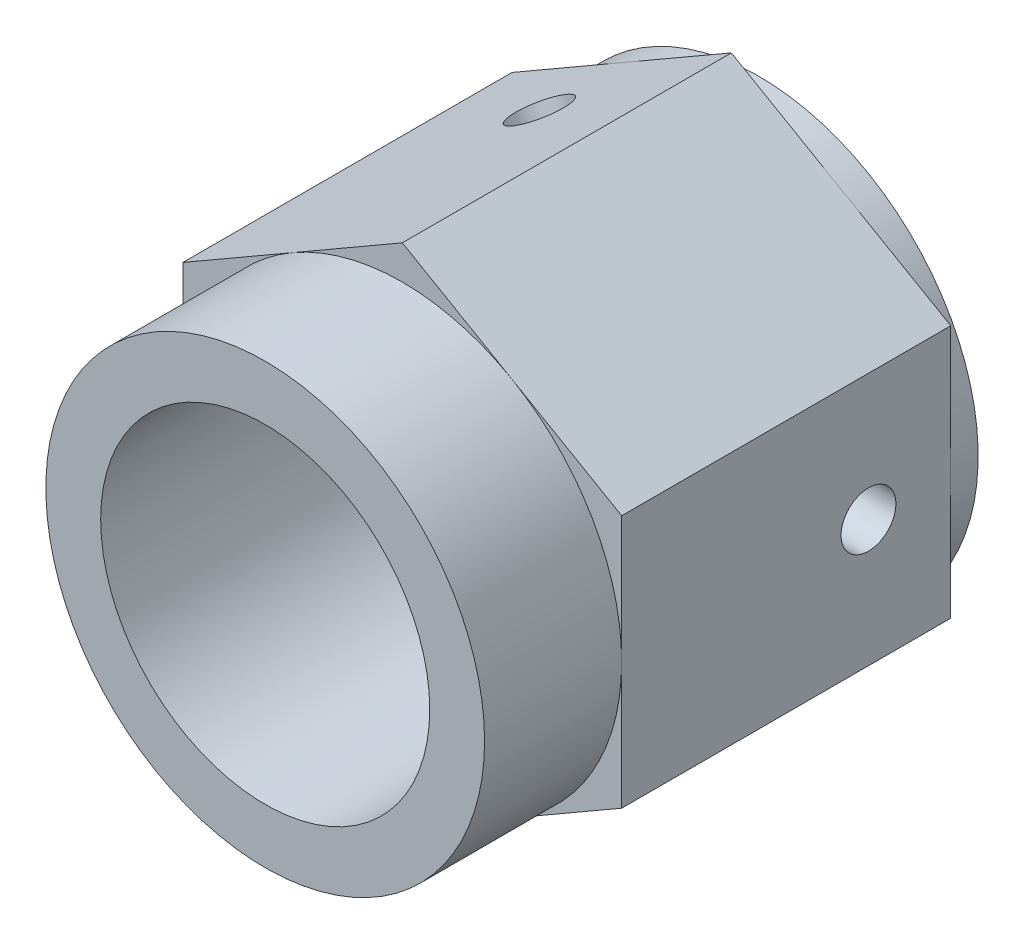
ISO-10303-21;
HEADER;
FILE_DESCRIPTION(('STEP AP214'),'2;1');
FILE_NAME('part.step','',(''),(''),'','','');
FILE_SCHEMA(('AUTOMOTIVE_DESIGN { 1 0 10303 214 1 1 1 1 }'));
ENDSEC;
DATA;
#1=APPLICATION_CONTEXT('core data for automotive mechanical design processes');
#2=APPLICATION_PROTOCOL_DEFINITION('international standard','automotive_design',2000,#1);
#3=PRODUCT_CONTEXT('',#1,'mechanical');
#4=PRODUCT('Part','Part','',(#3));
#5=PRODUCT_RELATED_PRODUCT_CATEGORY('part','',(#4));
#6=PRODUCT_DEFINITION_FORMATION('','',#4);
#7=PRODUCT_DEFINITION_CONTEXT('part definition',#1,'design');
#8=PRODUCT_DEFINITION('design','',#6,#7);
#9=PRODUCT_DEFINITION_SHAPE('','',#8);
#10=(LENGTH_UNIT() NAMED_UNIT(*) SI_UNIT(.MILLI.,.METRE.));
#11=(NAMED_UNIT(*) PLANE_ANGLE_UNIT() SI_UNIT($,.RADIAN.));
#12=(NAMED_UNIT(*) SI_UNIT($,.STERADIAN.) SOLID_ANGLE_UNIT());
#13=UNCERTAINTY_MEASURE_WITH_UNIT(LENGTH_MEASURE(1.E-05),#10,'distance_accuracy_value','');
#14=(GEOMETRIC_REPRESENTATION_CONTEXT(3) GLOBAL_UNCERTAINTY_ASSIGNED_CONTEXT((#13)) GLOBAL_UNIT_ASSIGNED_CONTEXT((#10,
#11,#12)) REPRESENTATION_CONTEXT('',''));
#15=CARTESIAN_POINT('',(0.,0.,0.));
#16=DIRECTION('',(0.,0.,1.));
#17=DIRECTION('',(1.,0.,0.));
#18=AXIS2_PLACEMENT_3D('',#15,#16,#17);
#19=CARTESIAN_POINT('',(0.,0.,0.));
#20=DIRECTION('',(0.,0.,1.));
#21=DIRECTION('',(1.,0.,0.));
#22=AXIS2_PLACEMENT_3D('',#19,#20,#21);
#23=PLANE('',#22);
#24=CARTESIAN_POINT('',(0.,0.,0.));
#25=DIRECTION('',(0.,0.,-1.));
#26=DIRECTION('',(-1.,0.,0.));
#27=AXIS2_PLACEMENT_3D('',#24,#25,#26);
#28=CIRCLE('',#27,40.);
#29=CARTESIAN_POINT('',(-40.,0.,0.));
#30=VERTEX_POINT('',#29);
#31=CARTESIAN_POINT('',(-20.,34.6410161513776,0.));
#32=VERTEX_POINT('',#31);
#33=EDGE_CURVE('E51',#30,#32,#28,.T.);
#34=ORIENTED_EDGE('',*,*,#33,.F.);
#35=DIRECTION('',(0.,-1.,0.));
#36=VECTOR('',#35,1.);
#37=CARTESIAN_POINT('',(-40.,23.094010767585,0.));
#38=LINE('',#37,#36);
#39=CARTESIAN_POINT('',(-40.,23.094010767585,0.));
#40=VERTEX_POINT('',#39);
#41=EDGE_CURVE('E134',#40,#30,#38,.T.);
#42=ORIENTED_EDGE('',*,*,#41,.F.);
#43=DIRECTION('',(-0.866025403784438,-0.5,0.));
#44=VECTOR('',#43,1.);
#45=CARTESIAN_POINT('',(0.,46.1880215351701,0.));
#46=LINE('',#45,#44);
#47=EDGE_CURVE('E151',#32,#40,#46,.T.);
#48=ORIENTED_EDGE('',*,*,#47,.F.);
#49=EDGE_LOOP('',(#34,#42,#48));
#50=FACE_BOUND('',#49,.T.);
#51=ADVANCED_FACE('F36',(#50),#23,.F.);
#52=CARTESIAN_POINT('',(20.,34.6410161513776,0.));
#53=VERTEX_POINT('',#52);
#54=EDGE_CURVE('E11',#32,#53,#28,.T.);
#55=ORIENTED_EDGE('',*,*,#54,.F.);
#56=CARTESIAN_POINT('',(0.,46.1880215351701,0.));
#57=VERTEX_POINT('',#56);
#58=EDGE_CURVE('E149',#57,#32,#46,.T.);
#59=ORIENTED_EDGE('',*,*,#58,.F.);
#60=DIRECTION('',(-0.866025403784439,0.5,0.));
#61=VECTOR('',#60,1.);
#62=CARTESIAN_POINT('',(40.,23.0940107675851,0.));
#63=LINE('',#62,#61);
#64=EDGE_CURVE('E171',#53,#57,#63,.T.);
#65=ORIENTED_EDGE('',*,*,#64,.F.);
#66=EDGE_LOOP('',(#55,#59,#65));
#67=FACE_BOUND('',#66,.T.);
#68=ADVANCED_FACE('F259',(#67),#23,.F.);
#69=CARTESIAN_POINT('',(40.,0.,0.));
#70=VERTEX_POINT('',#69);
#71=EDGE_CURVE('E49',#53,#70,#28,.T.);
#72=ORIENTED_EDGE('',*,*,#71,.F.);
#73=CARTESIAN_POINT('',(40.,23.0940107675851,0.));
#74=VERTEX_POINT('',#73);
#75=EDGE_CURVE('E199',#74,#53,#63,.T.);
#76=ORIENTED_EDGE('',*,*,#75,.F.);
#77=DIRECTION('',(0.,1.,0.));
#78=VECTOR('',#77,1.);
#79=CARTESIAN_POINT('',(40.,-23.094010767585,0.));
#80=LINE('',#79,#78);
#81=EDGE_CURVE('E208',#70,#74,#80,.T.);
#82=ORIENTED_EDGE('',*,*,#81,.F.);
#83=EDGE_LOOP('',(#72,#76,#82));
#84=FACE_BOUND('',#83,.T.);
#85=ADVANCED_FACE('F265',(#84),#23,.F.);
#86=CARTESIAN_POINT('',(20.,-34.6410161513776,0.));
#87=VERTEX_POINT('',#86);
#88=EDGE_CURVE('E161',#70,#87,#28,.T.);
#89=ORIENTED_EDGE('',*,*,#88,.F.);
#90=CARTESIAN_POINT('',(40.,-23.094010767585,0.));
#91=VERTEX_POINT('',#90);
#92=EDGE_CURVE('E209',#91,#70,#80,.T.);
#93=ORIENTED_EDGE('',*,*,#92,.F.);
#94=DIRECTION('',(0.866025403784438,0.5,0.));
#95=VECTOR('',#94,1.);
#96=CARTESIAN_POINT('',(0.,-46.1880215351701,0.));
#97=LINE('',#96,#95);
#98=EDGE_CURVE('E204',#87,#91,#97,.T.);
#99=ORIENTED_EDGE('',*,*,#98,.F.);
#100=EDGE_LOOP('',(#89,#93,#99));
#101=FACE_BOUND('',#100,.T.);
#102=ADVANCED_FACE('F286',(#101),#23,.F.);
#103=CARTESIAN_POINT('',(-20.,-34.6410161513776,0.));
#104=VERTEX_POINT('',#103);
#105=EDGE_CURVE('E159',#87,#104,#28,.T.);
#106=ORIENTED_EDGE('',*,*,#105,.F.);
#107=CARTESIAN_POINT('',(0.,-46.1880215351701,0.));
#108=VERTEX_POINT('',#107);
#109=EDGE_CURVE('E205',#108,#87,#97,.T.);
#110=ORIENTED_EDGE('',*,*,#109,.F.);
#111=DIRECTION('',(0.866025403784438,-0.5,0.));
#112=VECTOR('',#111,1.);
#113=CARTESIAN_POINT('',(-40.,-23.094010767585,0.));
#114=LINE('',#113,#112);
#115=EDGE_CURVE('E144',#104,#108,#114,.T.);
#116=ORIENTED_EDGE('',*,*,#115,.F.);
#117=EDGE_LOOP('',(#106,#110,#116));
#118=FACE_BOUND('',#117,.T.);
#119=ADVANCED_FACE('F271',(#118),#23,.F.);
#120=CARTESIAN_POINT('',(0.,0.,60.));
#121=DIRECTION('',(0.,0.,1.));
#122=DIRECTION('',(1.,0.,0.));
#123=AXIS2_PLACEMENT_3D('',#120,#121,#122);
#124=PLANE('',#123);
#125=CARTESIAN_POINT('',(0.,0.,60.));
#126=DIRECTION('',(0.,0.,1.));
#127=DIRECTION('',(1.,0.,0.));
#128=AXIS2_PLACEMENT_3D('',#125,#126,#127);
#129=CIRCLE('',#128,40.);
#130=CARTESIAN_POINT('',(40.,0.,60.));
#131=VERTEX_POINT('',#130);
#132=CARTESIAN_POINT('',(20.,34.6410161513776,60.));
#133=VERTEX_POINT('',#132);
#134=EDGE_CURVE('E165',#131,#133,#129,.T.);
#135=ORIENTED_EDGE('',*,*,#134,.F.);
#136=DIRECTION('',(0.,1.,0.));
#137=VECTOR('',#136,1.);
#138=CARTESIAN_POINT('',(40.,-23.094010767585,60.));
#139=LINE('',#138,#137);
#140=CARTESIAN_POINT('',(40.,23.0940107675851,60.));
#141=VERTEX_POINT('',#140);
#142=EDGE_CURVE('E195',#131,#141,#139,.T.);
#143=ORIENTED_EDGE('',*,*,#142,.T.);
#144=DIRECTION('',(-0.866025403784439,0.5,0.));
#145=VECTOR('',#144,1.);
#146=CARTESIAN_POINT('',(40.,23.0940107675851,60.));
#147=LINE('',#146,#145);
#148=EDGE_CURVE('E175',#141,#133,#147,.T.);
#149=ORIENTED_EDGE('',*,*,#148,.T.);
#150=EDGE_LOOP('',(#135,#143,#149));
#151=FACE_BOUND('',#150,.T.);
#152=ADVANCED_FACE('F283',(#151),#124,.T.);
#153=CARTESIAN_POINT('',(-20.,34.6410161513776,60.));
#154=VERTEX_POINT('',#153);
#155=EDGE_CURVE('E160',#133,#154,#129,.T.);
#156=ORIENTED_EDGE('',*,*,#155,.F.);
#157=CARTESIAN_POINT('',(0.,46.1880215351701,60.));
#158=VERTEX_POINT('',#157);
#159=EDGE_CURVE('E179',#133,#158,#147,.T.);
#160=ORIENTED_EDGE('',*,*,#159,.T.);
#161=DIRECTION('',(-0.866025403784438,-0.5,0.));
#162=VECTOR('',#161,1.);
#163=CARTESIAN_POINT('',(0.,46.1880215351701,60.));
#164=LINE('',#163,#162);
#165=EDGE_CURVE('E180',#158,#154,#164,.T.);
#166=ORIENTED_EDGE('',*,*,#165,.T.);
#167=EDGE_LOOP('',(#156,#160,#166));
#168=FACE_BOUND('',#167,.T.);
#169=ADVANCED_FACE('F293',(#168),#124,.T.);
#170=CARTESIAN_POINT('',(-40.,0.,60.));
#171=VERTEX_POINT('',#170);
#172=EDGE_CURVE('E163',#154,#171,#129,.T.);
#173=ORIENTED_EDGE('',*,*,#172,.F.);
#174=CARTESIAN_POINT('',(-40.,23.094010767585,60.));
#175=VERTEX_POINT('',#174);
#176=EDGE_CURVE('E178',#154,#175,#164,.T.);
#177=ORIENTED_EDGE('',*,*,#176,.T.);
#178=DIRECTION('',(0.,-1.,0.));
#179=VECTOR('',#178,1.);
#180=CARTESIAN_POINT('',(-40.,23.094010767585,60.));
#181=LINE('',#180,#179);
#182=EDGE_CURVE('E184',#175,#171,#181,.T.);
#183=ORIENTED_EDGE('',*,*,#182,.T.);
#184=EDGE_LOOP('',(#173,#177,#183));
#185=FACE_BOUND('',#184,.T.);
#186=ADVANCED_FACE('F329',(#185),#124,.T.);
#187=CARTESIAN_POINT('',(-20.,-34.6410161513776,60.));
#188=VERTEX_POINT('',#187);
#189=EDGE_CURVE('E326',#171,#188,#129,.T.);
#190=ORIENTED_EDGE('',*,*,#189,.F.);
#191=CARTESIAN_POINT('',(-40.,-23.094010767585,60.));
#192=VERTEX_POINT('',#191);
#193=EDGE_CURVE('E183',#171,#192,#181,.T.);
#194=ORIENTED_EDGE('',*,*,#193,.T.);
#195=DIRECTION('',(0.866025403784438,-0.5,0.));
#196=VECTOR('',#195,1.);
#197=CARTESIAN_POINT('',(-40.,-23.094010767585,60.));
#198=LINE('',#197,#196);
#199=EDGE_CURVE('E188',#192,#188,#198,.T.);
#200=ORIENTED_EDGE('',*,*,#199,.T.);
#201=EDGE_LOOP('',(#190,#194,#200));
#202=FACE_BOUND('',#201,.T.);
#203=ADVANCED_FACE('F338',(#202),#124,.T.);
#204=CARTESIAN_POINT('',(20.,-34.6410161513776,60.));
#205=VERTEX_POINT('',#204);
#206=EDGE_CURVE('E320',#188,#205,#129,.T.);
#207=ORIENTED_EDGE('',*,*,#206,.F.);
#208=CARTESIAN_POINT('',(0.,-46.1880215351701,60.));
#209=VERTEX_POINT('',#208);
#210=EDGE_CURVE('E187',#188,#209,#198,.T.);
#211=ORIENTED_EDGE('',*,*,#210,.T.);
#212=DIRECTION('',(0.866025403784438,0.5,0.));
#213=VECTOR('',#212,1.);
#214=CARTESIAN_POINT('',(0.,-46.1880215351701,60.));
#215=LINE('',#214,#213);
#216=EDGE_CURVE('E192',#209,#205,#215,.T.);
#217=ORIENTED_EDGE('',*,*,#216,.T.);
#218=EDGE_LOOP('',(#207,#211,#217));
#219=FACE_BOUND('',#218,.T.);
#220=ADVANCED_FACE('F284',(#219),#124,.T.);
#221=CARTESIAN_POINT('',(40.,23.0940107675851,60.));
#222=DIRECTION('',(-0.5,-0.866025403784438,0.));
#223=DIRECTION('',(0.866025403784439,-0.5,0.));
#224=AXIS2_PLACEMENT_3D('',#221,#222,#223);
#225=PLANE('',#224);
#226=ORIENTED_EDGE('',*,*,#75,.T.);
#227=ORIENTED_EDGE('',*,*,#64,.T.);
#228=DIRECTION('',(0.,0.,-1.));
#229=VECTOR('',#228,1.);
#230=CARTESIAN_POINT('',(0.,46.1880215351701,60.));
#231=LINE('',#230,#229);
#232=EDGE_CURVE('E223',#158,#57,#231,.T.);
#233=ORIENTED_EDGE('',*,*,#232,.F.);
#234=ORIENTED_EDGE('',*,*,#159,.F.);
#235=ORIENTED_EDGE('',*,*,#148,.F.);
#236=DIRECTION('',(0.,0.,-1.));
#237=VECTOR('',#236,1.);
#238=CARTESIAN_POINT('',(40.,23.0940107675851,60.));
#239=LINE('',#238,#237);
#240=EDGE_CURVE('E198',#141,#74,#239,.T.);
#241=ORIENTED_EDGE('',*,*,#240,.T.);
#242=EDGE_LOOP('',(#226,#227,#233,#234,#235,#241));
#243=FACE_BOUND('',#242,.T.);
#244=ADVANCED_FACE('F38',(#243),#225,.F.);
#245=CARTESIAN_POINT('',(0.,46.1880215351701,60.));
#246=DIRECTION('',(0.5,-0.866025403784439,0.));
#247=DIRECTION('',(0.866025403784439,0.5,0.));
#248=AXIS2_PLACEMENT_3D('',#245,#246,#247);
#249=PLANE('',#248);
#250=CARTESIAN_POINT('',(-20.,34.6410161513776,15.));
#251=DIRECTION('',(-0.5,0.866025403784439,0.));
#252=DIRECTION('',(-0.866025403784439,-0.5,0.));
#253=AXIS2_PLACEMENT_3D('',#250,#251,#252);
#254=CIRCLE('',#253,5.);
#255=CARTESIAN_POINT('',(-24.3301270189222,32.1410161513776,15.));
#256=VERTEX_POINT('',#255);
#257=EDGE_CURVE('E232',#256,#256,#254,.T.);
#258=ORIENTED_EDGE('',*,*,#257,.F.);
#259=EDGE_LOOP('',(#258));
#260=FACE_BOUND('',#259,.T.);
#261=ORIENTED_EDGE('',*,*,#58,.T.);
#262=ORIENTED_EDGE('',*,*,#47,.T.);
#263=DIRECTION('',(0.,0.,-1.));
#264=VECTOR('',#263,1.);
#265=CARTESIAN_POINT('',(-40.,23.094010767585,60.));
#266=LINE('',#265,#264);
#267=EDGE_CURVE('E141',#175,#40,#266,.T.);
#268=ORIENTED_EDGE('',*,*,#267,.F.);
#269=ORIENTED_EDGE('',*,*,#176,.F.);
#270=ORIENTED_EDGE('',*,*,#165,.F.);
#271=ORIENTED_EDGE('',*,*,#232,.T.);
#272=EDGE_LOOP('',(#261,#262,#268,#269,#270,#271));
#273=FACE_BOUND('',#272,.T.);
#274=ADVANCED_FACE('F332',(#260,#273),#249,.F.);
#275=CARTESIAN_POINT('',(-40.,23.094010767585,60.));
#276=DIRECTION('',(1.,0.,0.));
#277=DIRECTION('',(0.,0.,-1.));
#278=AXIS2_PLACEMENT_3D('',#275,#276,#277);
#279=PLANE('',#278);
#280=ORIENTED_EDGE('',*,*,#41,.T.);
#281=CARTESIAN_POINT('',(-40.,-23.094010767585,0.));
#282=VERTEX_POINT('',#281);
#283=EDGE_CURVE('E137',#30,#282,#38,.T.);
#284=ORIENTED_EDGE('',*,*,#283,.T.);
#285=DIRECTION('',(0.,0.,-1.));
#286=VECTOR('',#285,1.);
#287=CARTESIAN_POINT('',(-40.,-23.094010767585,60.));
#288=LINE('',#287,#286);
#289=EDGE_CURVE('E220',#192,#282,#288,.T.);
#290=ORIENTED_EDGE('',*,*,#289,.F.);
#291=ORIENTED_EDGE('',*,*,#193,.F.);
#292=ORIENTED_EDGE('',*,*,#182,.F.);
#293=ORIENTED_EDGE('',*,*,#267,.T.);
#294=EDGE_LOOP('',(#280,#284,#290,#291,#292,#293));
#295=FACE_BOUND('',#294,.T.);
#296=ADVANCED_FACE('F135',(#295),#279,.F.);
#297=CARTESIAN_POINT('',(-40.,-23.094010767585,60.));
#298=DIRECTION('',(0.5,0.866025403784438,0.));
#299=DIRECTION('',(-0.866025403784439,0.5,0.));
#300=AXIS2_PLACEMENT_3D('',#297,#298,#299);
#301=PLANE('',#300);
#302=CARTESIAN_POINT('',(-20.,-34.6410161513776,15.));
#303=DIRECTION('',(-0.5,-0.866025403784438,0.));
#304=DIRECTION('',(0.866025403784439,-0.5,0.));
#305=AXIS2_PLACEMENT_3D('',#302,#303,#304);
#306=CIRCLE('',#305,5.);
#307=CARTESIAN_POINT('',(-15.6698729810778,-37.1410161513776,15.));
#308=VERTEX_POINT('',#307);
#309=EDGE_CURVE('E369',#308,#308,#306,.T.);
#310=ORIENTED_EDGE('',*,*,#309,.F.);
#311=EDGE_LOOP('',(#310));
#312=FACE_BOUND('',#311,.T.);
#313=EDGE_CURVE('E148',#282,#104,#114,.T.);
#314=ORIENTED_EDGE('',*,*,#313,.T.);
#315=ORIENTED_EDGE('',*,*,#115,.T.);
#316=DIRECTION('',(0.,0.,-1.));
#317=VECTOR('',#316,1.);
#318=CARTESIAN_POINT('',(0.,-46.1880215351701,60.));
#319=LINE('',#318,#317);
#320=EDGE_CURVE('E217',#209,#108,#319,.T.);
#321=ORIENTED_EDGE('',*,*,#320,.F.);
#322=ORIENTED_EDGE('',*,*,#210,.F.);
#323=ORIENTED_EDGE('',*,*,#199,.F.);
#324=ORIENTED_EDGE('',*,*,#289,.T.);
#325=EDGE_LOOP('',(#314,#315,#321,#322,#323,#324));
#326=FACE_BOUND('',#325,.T.);
#327=ADVANCED_FACE('F400',(#312,#326),#301,.F.);
#328=CARTESIAN_POINT('',(0.,-46.1880215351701,60.));
#329=DIRECTION('',(-0.5,0.866025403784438,0.));
#330=DIRECTION('',(-0.866025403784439,-0.5,0.));
#331=AXIS2_PLACEMENT_3D('',#328,#329,#330);
#332=PLANE('',#331);
#333=ORIENTED_EDGE('',*,*,#109,.T.);
#334=ORIENTED_EDGE('',*,*,#98,.T.);
#335=DIRECTION('',(0.,0.,-1.));
#336=VECTOR('',#335,1.);
#337=CARTESIAN_POINT('',(40.,-23.094010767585,60.));
#338=LINE('',#337,#336);
#339=CARTESIAN_POINT('',(40.,-23.094010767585,60.));
#340=VERTEX_POINT('',#339);
#341=EDGE_CURVE('E214',#340,#91,#338,.T.);
#342=ORIENTED_EDGE('',*,*,#341,.F.);
#343=EDGE_CURVE('E191',#205,#340,#215,.T.);
#344=ORIENTED_EDGE('',*,*,#343,.F.);
#345=ORIENTED_EDGE('',*,*,#216,.F.);
#346=ORIENTED_EDGE('',*,*,#320,.T.);
#347=EDGE_LOOP('',(#333,#334,#342,#344,#345,#346));
#348=FACE_BOUND('',#347,.T.);
#349=ADVANCED_FACE('F302',(#348),#332,.F.);
#350=CARTESIAN_POINT('',(40.,-23.094010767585,60.));
#351=DIRECTION('',(-1.,0.,0.));
#352=DIRECTION('',(0.,0.,1.));
#353=AXIS2_PLACEMENT_3D('',#350,#351,#352);
#354=PLANE('',#353);
#355=CARTESIAN_POINT('',(40.,0.,15.));
#356=DIRECTION('',(1.,0.,0.));
#357=DIRECTION('',(0.,0.,-1.));
#358=AXIS2_PLACEMENT_3D('',#355,#356,#357);
#359=CIRCLE('',#358,5.);
#360=CARTESIAN_POINT('',(40.,0.,10.));
#361=VERTEX_POINT('',#360);
#362=EDGE_CURVE('E372',#361,#361,#359,.T.);
#363=ORIENTED_EDGE('',*,*,#362,.F.);
#364=EDGE_LOOP('',(#363));
#365=FACE_BOUND('',#364,.T.);
#366=ORIENTED_EDGE('',*,*,#92,.T.);
#367=ORIENTED_EDGE('',*,*,#81,.T.);
#368=ORIENTED_EDGE('',*,*,#240,.F.);
#369=ORIENTED_EDGE('',*,*,#142,.F.);
#370=EDGE_CURVE('E196',#340,#131,#139,.T.);
#371=ORIENTED_EDGE('',*,*,#370,.F.);
#372=ORIENTED_EDGE('',*,*,#341,.T.);
#373=EDGE_LOOP('',(#366,#367,#368,#369,#371,#372));
#374=FACE_BOUND('',#373,.T.);
#375=ADVANCED_FACE('F281',(#365,#374),#354,.F.);
#376=EDGE_CURVE('E174',#205,#131,#129,.T.);
#377=ORIENTED_EDGE('',*,*,#376,.F.);
#378=ORIENTED_EDGE('',*,*,#343,.T.);
#379=ORIENTED_EDGE('',*,*,#370,.T.);
#380=EDGE_LOOP('',(#377,#378,#379));
#381=FACE_BOUND('',#380,.T.);
#382=ADVANCED_FACE('F270',(#381),#124,.T.);
#383=EDGE_CURVE('E64',#104,#30,#28,.T.);
#384=ORIENTED_EDGE('',*,*,#383,.F.);
#385=ORIENTED_EDGE('',*,*,#313,.F.);
#386=ORIENTED_EDGE('',*,*,#283,.F.);
#387=EDGE_LOOP('',(#384,#385,#386));
#388=FACE_BOUND('',#387,.T.);
#389=ADVANCED_FACE('F146',(#388),#23,.F.);
#390=CARTESIAN_POINT('',(0.,0.,85.));
#391=DIRECTION('',(0.,0.,-1.));
#392=DIRECTION('',(-1.,0.,0.));
#393=AXIS2_PLACEMENT_3D('',#390,#391,#392);
#394=CYLINDRICAL_SURFACE('',#393,40.);
#395=CARTESIAN_POINT('',(0.,0.,85.));
#396=DIRECTION('',(0.,0.,1.));
#397=DIRECTION('',(1.,0.,0.));
#398=AXIS2_PLACEMENT_3D('',#395,#396,#397);
#399=CIRCLE('',#398,40.);
#400=CARTESIAN_POINT('',(40.,0.,85.));
#401=VERTEX_POINT('',#400);
#402=EDGE_CURVE('E169',#401,#401,#399,.T.);
#403=ORIENTED_EDGE('',*,*,#402,.F.);
#404=EDGE_LOOP('',(#403));
#405=FACE_BOUND('',#404,.T.);
#406=ORIENTED_EDGE('',*,*,#134,.T.);
#407=ORIENTED_EDGE('',*,*,#155,.T.);
#408=ORIENTED_EDGE('',*,*,#172,.T.);
#409=ORIENTED_EDGE('',*,*,#189,.T.);
#410=ORIENTED_EDGE('',*,*,#206,.T.);
#411=ORIENTED_EDGE('',*,*,#376,.T.);
#412=EDGE_LOOP('',(#406,#407,#408,#409,#410,#411));
#413=FACE_BOUND('',#412,.T.);
#414=ADVANCED_FACE('F269',(#405,#413),#394,.T.);
#415=CARTESIAN_POINT('',(0.,0.,85.));
#416=DIRECTION('',(0.,0.,1.));
#417=DIRECTION('',(1.,0.,0.));
#418=AXIS2_PLACEMENT_3D('',#415,#416,#417);
#419=PLANE('',#418);
#420=CARTESIAN_POINT('',(0.,0.,85.));
#421=DIRECTION('',(0.,0.,1.));
#422=DIRECTION('',(1.,0.,0.));
#423=AXIS2_PLACEMENT_3D('',#420,#421,#422);
#424=CIRCLE('',#423,30.);
#425=CARTESIAN_POINT('',(30.,0.,85.));
#426=VERTEX_POINT('',#425);
#427=EDGE_CURVE('E231',#426,#426,#424,.T.);
#428=ORIENTED_EDGE('',*,*,#427,.F.);
#429=EDGE_LOOP('',(#428));
#430=FACE_BOUND('',#429,.T.);
#431=ORIENTED_EDGE('',*,*,#402,.T.);
#432=EDGE_LOOP('',(#431));
#433=FACE_BOUND('',#432,.T.);
#434=ADVANCED_FACE('F277',(#430,#433),#419,.T.);
#435=CARTESIAN_POINT('',(0.,0.,-5.));
#436=DIRECTION('',(0.,0.,1.));
#437=DIRECTION('',(1.,0.,0.));
#438=AXIS2_PLACEMENT_3D('',#435,#436,#437);
#439=CYLINDRICAL_SURFACE('',#438,40.);
#440=CARTESIAN_POINT('',(0.,0.,-5.));
#441=DIRECTION('',(0.,0.,-1.));
#442=DIRECTION('',(-1.,0.,0.));
#443=AXIS2_PLACEMENT_3D('',#440,#441,#442);
#444=CIRCLE('',#443,40.);
#445=CARTESIAN_POINT('',(-40.,0.,-5.));
#446=VERTEX_POINT('',#445);
#447=EDGE_CURVE('E154',#446,#446,#444,.T.);
#448=ORIENTED_EDGE('',*,*,#447,.F.);
#449=EDGE_LOOP('',(#448));
#450=FACE_BOUND('',#449,.T.);
#451=ORIENTED_EDGE('',*,*,#33,.T.);
#452=ORIENTED_EDGE('',*,*,#54,.T.);
#453=ORIENTED_EDGE('',*,*,#71,.T.);
#454=ORIENTED_EDGE('',*,*,#88,.T.);
#455=ORIENTED_EDGE('',*,*,#105,.T.);
#456=ORIENTED_EDGE('',*,*,#383,.T.);
#457=EDGE_LOOP('',(#451,#452,#453,#454,#455,#456));
#458=FACE_BOUND('',#457,.T.);
#459=ADVANCED_FACE('F157',(#450,#458),#439,.T.);
#460=CARTESIAN_POINT('',(0.,0.,-5.));
#461=DIRECTION('',(0.,0.,-1.));
#462=DIRECTION('',(-1.,0.,0.));
#463=AXIS2_PLACEMENT_3D('',#460,#461,#462);
#464=PLANE('',#463);
#465=CARTESIAN_POINT('',(0.,0.,-5.));
#466=DIRECTION('',(0.,0.,-1.));
#467=DIRECTION('',(-1.,0.,0.));
#468=AXIS2_PLACEMENT_3D('',#465,#466,#467);
#469=CIRCLE('',#468,15.);
#470=CARTESIAN_POINT('',(-15.,0.,-5.));
#471=VERTEX_POINT('',#470);
#472=EDGE_CURVE('E155',#471,#471,#469,.T.);
#473=ORIENTED_EDGE('',*,*,#472,.F.);
#474=EDGE_LOOP('',(#473));
#475=FACE_BOUND('',#474,.T.);
#476=ORIENTED_EDGE('',*,*,#447,.T.);
#477=EDGE_LOOP('',(#476));
#478=FACE_BOUND('',#477,.T.);
#479=ADVANCED_FACE('F344',(#475,#478),#464,.T.);
#480=CARTESIAN_POINT('',(0.,0.,40.));
#481=DIRECTION('',(0.,0.,-1.));
#482=DIRECTION('',(-1.,0.,0.));
#483=AXIS2_PLACEMENT_3D('',#480,#481,#482);
#484=CYLINDRICAL_SURFACE('',#483,15.);
#485=CARTESIAN_POINT('',(15.,0.,10.));
#486=CARTESIAN_POINT('',(15.0000007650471,0.272816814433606,9.99999873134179));
#487=CARTESIAN_POINT('',(14.9924884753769,0.545625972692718,10.022401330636));
#488=CARTESIAN_POINT('',(14.9632605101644,1.08320880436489,10.1111455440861));
#489=CARTESIAN_POINT('',(14.941543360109,1.3479816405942,10.1774917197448));
#490=CARTESIAN_POINT('',(14.8862653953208,1.86166394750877,10.3515962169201));
#491=CARTESIAN_POINT('',(14.8527243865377,2.11059912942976,10.4592853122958));
#492=CARTESIAN_POINT('',(14.7772222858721,2.58687468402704,10.7127058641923));
#493=CARTESIAN_POINT('',(14.7352595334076,2.81421078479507,10.8584448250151));
#494=CARTESIAN_POINT('',(14.6457047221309,3.24870837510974,11.1891290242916));
#495=CARTESIAN_POINT('',(14.5979778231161,3.45501850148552,11.3751561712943));
#496=CARTESIAN_POINT('',(14.5030157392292,3.83416346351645,11.778835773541));
#497=CARTESIAN_POINT('',(14.4557806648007,4.00699092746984,11.9964951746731));
#498=CARTESIAN_POINT('',(14.3656666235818,4.31912471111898,12.4649255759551));
#499=CARTESIAN_POINT('',(14.3229519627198,4.45732429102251,12.7164686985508));
#500=CARTESIAN_POINT('',(14.2487652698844,4.68909436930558,13.2408804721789));
#501=CARTESIAN_POINT('',(14.2172898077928,4.78267848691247,13.5137425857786));
#502=CARTESIAN_POINT('',(14.1705651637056,4.91936730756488,14.0633661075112));
#503=CARTESIAN_POINT('',(14.1548047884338,4.96406724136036,14.3396860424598));
#504=CARTESIAN_POINT('',(14.1397828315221,5.00670561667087,14.896318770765));
#505=CARTESIAN_POINT('',(14.1405161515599,5.00465850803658,15.1766303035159));
#506=CARTESIAN_POINT('',(14.1579507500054,4.95509951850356,15.7196831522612));
#507=CARTESIAN_POINT('',(14.1739207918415,4.90966956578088,15.9826420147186));
#508=CARTESIAN_POINT('',(14.2188328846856,4.77803081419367,16.4969670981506));
#509=CARTESIAN_POINT('',(14.2477764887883,4.69181713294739,16.7483319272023));
#510=CARTESIAN_POINT('',(14.3158955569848,4.47969529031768,17.2370637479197));
#511=CARTESIAN_POINT('',(14.3552282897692,4.35317024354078,17.4741401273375));
#512=CARTESIAN_POINT('',(14.4396279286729,4.06444553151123,17.9243545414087));
#513=CARTESIAN_POINT('',(14.4846964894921,3.9022355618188,18.1374856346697));
#514=CARTESIAN_POINT('',(14.5783664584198,3.53674666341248,18.5454579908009));
#515=CARTESIAN_POINT('',(14.6270294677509,3.3317657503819,18.7387634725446));
#516=CARTESIAN_POINT('',(14.7203469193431,2.89169784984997,19.0886563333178));
#517=CARTESIAN_POINT('',(14.765000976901,2.65660797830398,19.2452401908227));
#518=CARTESIAN_POINT('',(14.8458553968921,2.15973806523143,19.5184815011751));
#519=CARTESIAN_POINT('',(14.8819675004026,1.89771638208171,19.6347274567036));
#520=CARTESIAN_POINT('',(14.9410283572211,1.35634541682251,19.8210158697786));
#521=CARTESIAN_POINT('',(14.9639816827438,1.07700219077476,19.8910743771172));
#522=CARTESIAN_POINT('',(14.9933813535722,0.521919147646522,19.9802783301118));
#523=CARTESIAN_POINT('',(15.0005000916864,0.246547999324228,20.0014990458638));
#524=CARTESIAN_POINT('',(14.9994451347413,-0.303875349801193,19.9983366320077));
#525=CARTESIAN_POINT('',(14.9912740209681,-0.578927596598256,19.9739612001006));
#526=CARTESIAN_POINT('',(14.9610012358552,-1.11259933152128,19.8819404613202));
#527=CARTESIAN_POINT('',(14.9393099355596,-1.37146403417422,19.8155689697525));
#528=CARTESIAN_POINT('',(14.8845923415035,-1.87427979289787,19.6430327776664));
#529=CARTESIAN_POINT('',(14.8515646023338,-2.11822894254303,19.5368630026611));
#530=CARTESIAN_POINT('',(14.7764465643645,-2.59144148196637,19.2846478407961));
#531=CARTESIAN_POINT('',(14.7341407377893,-2.82014979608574,19.1376270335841));
#532=CARTESIAN_POINT('',(14.6452626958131,-3.25032415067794,18.8090292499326));
#533=CARTESIAN_POINT('',(14.5986891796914,-3.45178183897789,18.6274417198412));
#534=CARTESIAN_POINT('',(14.5038423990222,-3.8312625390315,18.2251062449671));
#535=CARTESIAN_POINT('',(14.4555880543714,-4.00780484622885,18.0029538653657));
#536=CARTESIAN_POINT('',(14.3649986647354,-4.32128761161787,17.5311421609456));
#537=CARTESIAN_POINT('',(14.3226636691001,-4.45822773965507,17.2814826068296));
#538=CARTESIAN_POINT('',(14.2491195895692,-4.68798465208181,16.7616349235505));
#539=CARTESIAN_POINT('',(14.2178880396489,-4.78089066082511,16.4914896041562));
#540=CARTESIAN_POINT('',(14.1705416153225,-4.91947333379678,15.9381067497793));
#541=CARTESIAN_POINT('',(14.154419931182,-4.9651712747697,15.6548751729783));
#542=CARTESIAN_POINT('',(14.1398929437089,-5.00638141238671,15.0990145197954));
#543=CARTESIAN_POINT('',(14.1406200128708,-5.004351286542,14.8265882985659));
#544=CARTESIAN_POINT('',(14.1575634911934,-4.95621146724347,14.2861746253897));
#545=CARTESIAN_POINT('',(14.1737789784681,-4.91010439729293,14.0181869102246));
#546=CARTESIAN_POINT('',(14.2192262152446,-4.77685906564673,13.4993216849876));
#547=CARTESIAN_POINT('',(14.2482049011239,-4.69051673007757,13.2482158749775));
#548=CARTESIAN_POINT('',(14.3158199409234,-4.47989682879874,12.7638629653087));
#549=CARTESIAN_POINT('',(14.3544584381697,-4.35561084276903,12.53061984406));
#550=CARTESIAN_POINT('',(14.4391414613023,-4.06630346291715,12.0775816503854));
#551=CARTESIAN_POINT('',(14.4854355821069,-3.8997412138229,11.8588174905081));
#552=CARTESIAN_POINT('',(14.5791678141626,-3.53321441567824,11.451550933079));
#553=CARTESIAN_POINT('',(14.6266062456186,-3.33324042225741,11.2630571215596));
#554=CARTESIAN_POINT('',(14.7195015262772,-2.89620778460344,10.9142779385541));
#555=CARTESIAN_POINT('',(14.7648090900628,-2.65800756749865,10.755378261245));
#556=CARTESIAN_POINT('',(14.8462995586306,-2.15678678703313,10.4800478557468));
#557=CARTESIAN_POINT('',(14.8824847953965,-1.89377259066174,10.3636062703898));
#558=CARTESIAN_POINT('',(14.9402757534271,-1.36246823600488,10.1813918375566));
#559=CARTESIAN_POINT('',(14.9624606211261,-1.09493878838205,10.1135876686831));
#560=CARTESIAN_POINT('',(14.9923203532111,-0.551602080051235,10.0228985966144));
#561=CARTESIAN_POINT('',(14.9999992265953,-0.275797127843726,10.0000012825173));
#562=CARTESIAN_POINT('',(15.,0.,10.));
#563=B_SPLINE_CURVE_WITH_KNOTS('',3,(#485,#486,#487,#488,#489,#490,#491,#492,#493,#494,#495,
#496,#497,#498,#499,#500,#501,#502,#503,#504,#505,#506,#507,#508,#509,#510,#511,#512,#513,#514,
#515,#516,#517,#518,#519,#520,#521,#522,#523,#524,#525,#526,#527,#528,#529,#530,#531,#532,#533,
#534,#535,#536,#537,#538,#539,#540,#541,#542,#543,#544,#545,#546,#547,#548,#549,#550,#551,#552,
#553,#554,#555,#556,#557,#558,#559,#560,#561,#562),.UNSPECIFIED.,.T.,.F.,(4,2,2,2,2,2,2,2,2,2,2,
2,2,2,2,2,2,2,2,2,2,2,2,2,2,2,2,2,2,2,2,2,2,2,2,2,2,2,4),(0.,0.817435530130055,1.6349559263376,
2.45111336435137,3.2674318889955,4.1092342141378,4.95122166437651,5.81741924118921,
6.6833522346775,7.52009628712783,8.3565816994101,9.15484132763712,9.9531965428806,
10.764408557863,11.5758551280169,12.4296652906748,13.2835572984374,14.1459202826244,
15.0079834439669,15.832679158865,16.6572356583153,17.4579078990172,18.2586822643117,
19.0805199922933,19.9026090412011,20.7620511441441,21.6215004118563,22.479200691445,
23.3365142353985,24.1497833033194,24.9630039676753,25.7607793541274,26.5587319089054,
27.3915033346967,28.2245105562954,29.0899830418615,29.9552340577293,30.7818279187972,
31.6081933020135),.UNSPECIFIED.);
#564=CARTESIAN_POINT('',(15.,0.,10.));
#565=VERTEX_POINT('',#564);
#566=EDGE_CURVE('E40',#565,#565,#563,.T.);
#567=ORIENTED_EDGE('',*,*,#566,.T.);
#568=EDGE_LOOP('',(#567));
#569=FACE_BOUND('',#568,.T.);
#570=CARTESIAN_POINT('',(-2.74094079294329,-14.7474487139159,15.));
#571=CARTESIAN_POINT('',(-2.7409392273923,-14.7474485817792,15.2723408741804));
#572=CARTESIAN_POINT('',(-2.7642521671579,-14.7431730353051,15.544673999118));
#573=CARTESIAN_POINT('',(-2.85621974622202,-14.7256290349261,16.0812721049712));
#574=CARTESIAN_POINT('',(-2.92488185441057,-14.7123590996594,16.3455357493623));
#575=CARTESIAN_POINT('',(-3.10387971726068,-14.6756322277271,16.8581344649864));
#576=CARTESIAN_POINT('',(-3.21413379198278,-14.6521952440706,17.1064996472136));
#577=CARTESIAN_POINT('',(-3.47146220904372,-14.5933652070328,17.5818002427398));
#578=CARTESIAN_POINT('',(-3.61854467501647,-14.5579695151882,17.8087309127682));
#579=CARTESIAN_POINT('',(-3.94975384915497,-14.4716858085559,18.2435998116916));
#580=CARTESIAN_POINT('',(-4.13501077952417,-14.42029217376,18.4505771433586));
#581=CARTESIAN_POINT('',(-4.53246809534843,-14.3003416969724,18.8310340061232));
#582=CARTESIAN_POINT('',(-4.74467279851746,-14.231782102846,19.0045081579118));
#583=CARTESIAN_POINT('',(-5.19485467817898,-14.073797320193,19.317394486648));
#584=CARTESIAN_POINT('',(-5.43335983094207,-13.9838743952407,19.4557998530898));
#585=CARTESIAN_POINT('',(-5.92316770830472,-13.7835396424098,19.6879579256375));
#586=CARTESIAN_POINT('',(-6.1744669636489,-13.6731333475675,19.7817226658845));
#587=CARTESIAN_POINT('',(-6.67228822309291,-13.4370303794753,19.918679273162));
#588=CARTESIAN_POINT('',(-6.91867222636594,-13.3119993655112,19.963517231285));
#589=CARTESIAN_POINT('',(-7.40713565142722,-13.0465140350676,20.0065814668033));
#590=CARTESIAN_POINT('',(-7.64921616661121,-12.9060637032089,20.0048197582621));
#591=CARTESIAN_POINT('',(-8.11230738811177,-12.6198934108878,19.9557787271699));
#592=CARTESIAN_POINT('',(-8.33377208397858,-12.4745961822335,19.9102873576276));
#593=CARTESIAN_POINT('',(-8.76030230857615,-12.1788542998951,19.7780350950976));
#594=CARTESIAN_POINT('',(-8.96536672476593,-12.0284092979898,19.6912714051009));
#595=CARTESIAN_POINT('',(-9.35744889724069,-11.7260521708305,19.4778934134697));
#596=CARTESIAN_POINT('',(-9.54419402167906,-11.5741467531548,19.3507703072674));
#597=CARTESIAN_POINT('',(-9.8935865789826,-11.2769513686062,19.0607014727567));
#598=CARTESIAN_POINT('',(-10.0562272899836,-11.1316632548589,18.8977457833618));
#599=CARTESIAN_POINT('',(-10.3624817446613,-10.8473362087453,18.5316280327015));
#600=CARTESIAN_POINT('',(-10.5048391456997,-10.7089135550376,18.3269342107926));
#601=CARTESIAN_POINT('',(-10.7594278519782,-10.4531031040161,17.8877563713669));
#602=CARTESIAN_POINT('',(-10.8716545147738,-10.3357185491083,17.6532677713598));
#603=CARTESIAN_POINT('',(-11.0661436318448,-10.1272484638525,17.1567318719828));
#604=CARTESIAN_POINT('',(-11.1479560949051,-10.0365617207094,16.8943393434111));
#605=CARTESIAN_POINT('',(-11.2782028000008,-9.88998833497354,16.3521430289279));
#606=CARTESIAN_POINT('',(-11.326651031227,-9.83408710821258,16.0723465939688));
#607=CARTESIAN_POINT('',(-11.3879957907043,-9.7629744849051,15.5168082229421));
#608=CARTESIAN_POINT('',(-11.4023976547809,-9.74604111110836,15.2414528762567));
#609=CARTESIAN_POINT('',(-11.3998353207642,-9.74903958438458,14.6911192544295));
#610=CARTESIAN_POINT('',(-11.3828768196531,-9.76896473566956,14.4161409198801));
#611=CARTESIAN_POINT('',(-11.3190215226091,-9.84286385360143,13.8842151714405));
#612=CARTESIAN_POINT('',(-11.2731731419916,-9.89564470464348,13.6269728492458));
#613=CARTESIAN_POINT('',(-11.1531628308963,-10.0307060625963,13.1272819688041));
#614=CARTESIAN_POINT('',(-11.0789958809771,-10.1129917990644,12.8848360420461));
#615=CARTESIAN_POINT('',(-10.9003947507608,-10.3052941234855,12.413097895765));
#616=CARTESIAN_POINT('',(-10.7950751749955,-10.4161074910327,12.184466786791));
#617=CARTESIAN_POINT('',(-10.5562368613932,-10.6580822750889,11.7542697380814));
#618=CARTESIAN_POINT('',(-10.4227098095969,-10.7892496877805,11.5527118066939));
#619=CARTESIAN_POINT('',(-10.121669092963,-11.0723280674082,11.1723600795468));
#620=CARTESIAN_POINT('',(-9.95282935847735,-11.2249334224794,10.9951280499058));
#621=CARTESIAN_POINT('',(-9.58779783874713,-11.5382800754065,10.6804192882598));
#622=CARTESIAN_POINT('',(-9.39160702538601,-11.6990210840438,10.5429411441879));
#623=CARTESIAN_POINT('',(-8.97669175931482,-12.0202875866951,10.3128994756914));
#624=CARTESIAN_POINT('',(-8.75812567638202,-12.1808074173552,10.2200436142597));
#625=CARTESIAN_POINT('',(-8.30251436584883,-12.4957920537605,10.0813612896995));
#626=CARTESIAN_POINT('',(-8.06547584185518,-12.6502590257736,10.0355178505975));
#627=CARTESIAN_POINT('',(-7.59117962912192,-12.9401554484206,9.99368961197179));
#628=CARTESIAN_POINT('',(-7.35445585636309,-13.0761384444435,9.99546273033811));
#629=CARTESIAN_POINT('',(-6.87744560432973,-13.3331966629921,10.043286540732));
#630=CARTESIAN_POINT('',(-6.63715941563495,-13.4542730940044,10.0893336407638));
#631=CARTESIAN_POINT('',(-6.16430238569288,-13.6773061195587,10.2229111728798));
#632=CARTESIAN_POINT('',(-5.9316696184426,-13.7795358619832,10.3097710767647));
#633=CARTESIAN_POINT('',(-5.47712585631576,-13.966443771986,10.5218876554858));
#634=CARTESIAN_POINT('',(-5.25521680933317,-14.0511187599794,10.6471512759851));
#635=CARTESIAN_POINT('',(-4.82077704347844,-14.2061709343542,10.93784756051));
#636=CARTESIAN_POINT('',(-4.60889580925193,-14.2759042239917,11.1045934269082));
#637=CARTESIAN_POINT('',(-4.2104186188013,-14.3984692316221,11.471286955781));
#638=CARTESIAN_POINT('',(-4.02383076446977,-14.4512955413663,11.6712452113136));
#639=CARTESIAN_POINT('',(-3.67565609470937,-14.543841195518,12.1080467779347));
#640=CARTESIAN_POINT('',(-3.51533386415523,-14.5829665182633,12.3460275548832));
#641=CARTESIAN_POINT('',(-3.23570886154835,-14.6475555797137,12.8466721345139));
#642=CARTESIAN_POINT('',(-3.11639537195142,-14.6730228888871,13.1093294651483));
#643=CARTESIAN_POINT('',(-2.92896715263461,-14.7115582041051,13.6398091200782));
#644=CARTESIAN_POINT('',(-2.85878193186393,-14.7251346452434,13.9068613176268));
#645=CARTESIAN_POINT('',(-2.76477754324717,-14.7430783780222,14.4492802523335));
#646=CARTESIAN_POINT('',(-2.74094237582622,-14.7474488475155,14.7246440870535));
#647=CARTESIAN_POINT('',(-2.74094079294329,-14.7474487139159,15.));
#648=B_SPLINE_CURVE_WITH_KNOTS('',3,(#570,#571,#572,#573,#574,#575,#576,#577,#578,#579,#580,
#581,#582,#583,#584,#585,#586,#587,#588,#589,#590,#591,#592,#593,#594,#595,#596,#597,#598,#599,
#600,#601,#602,#603,#604,#605,#606,#607,#608,#609,#610,#611,#612,#613,#614,#615,#616,#617,#618,
#619,#620,#621,#622,#623,#624,#625,#626,#627,#628,#629,#630,#631,#632,#633,#634,#635,#636,#637,
#638,#639,#640,#641,#642,#643,#644,#645,#646,#647),.UNSPECIFIED.,.T.,.F.,(4,2,2,2,2,2,2,2,2,2,2,
2,2,2,2,2,2,2,2,2,2,2,2,2,2,2,2,2,2,2,2,2,2,2,2,2,2,2,4),(0.,0.81600292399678,1.63214027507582,
2.44668313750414,3.26140583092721,4.10506687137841,4.9488632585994,5.81467530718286,
6.68025381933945,7.51571593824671,8.35096266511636,9.15345024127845,9.95599220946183,
10.7690827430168,11.5823995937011,12.4340087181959,13.2857489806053,14.1496319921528,
15.0131525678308,15.837714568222,16.6621267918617,17.4582197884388,18.2544539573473,
19.0759428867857,19.8976742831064,20.7589404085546,21.6201759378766,22.4756895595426,
23.3308941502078,24.1459042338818,24.9608482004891,25.7628478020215,26.5649925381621,
27.3967759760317,28.2288252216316,29.0934451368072,29.9578389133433,30.7831606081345,
31.6081973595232),.UNSPECIFIED.);
#649=CARTESIAN_POINT('',(-2.74094079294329,-14.7474487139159,15.));
#650=VERTEX_POINT('',#649);
#651=EDGE_CURVE('E233',#650,#650,#648,.T.);
#652=ORIENTED_EDGE('',*,*,#651,.T.);
#653=EDGE_LOOP('',(#652));
#654=FACE_BOUND('',#653,.T.);
#655=CARTESIAN_POINT('',(-11.4011948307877,9.74744871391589,15.));
#656=CARTESIAN_POINT('',(-11.4011954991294,9.7474472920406,15.2723408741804));
#657=CARTESIAN_POINT('',(-11.385836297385,9.76549911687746,15.544673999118));
#658=CARTESIAN_POINT('',(-11.3246589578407,9.83637337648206,16.0812721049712));
#659=CARTESIAN_POINT('',(-11.2788358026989,9.88920153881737,16.3455357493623));
#660=CARTESIAN_POINT('',(-11.1575304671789,10.0258547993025,16.8581344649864));
#661=CARTESIAN_POINT('',(-11.0821064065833,10.1096191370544,17.1064996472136));
#662=CARTESIAN_POINT('',(-10.9024938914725,10.3030570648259,17.5818002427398));
#663=CARTESIAN_POINT('',(-10.7982990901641,10.4127363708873,17.8087309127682));
#664=CARTESIAN_POINT('',(-10.5579706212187,10.6564300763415,18.2435998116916));
#665=CARTESIAN_POINT('',(-10.420833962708,10.7911704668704,18.4505771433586));
#666=CARTESIAN_POINT('',(-10.1182251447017,11.0754033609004,18.8310340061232));
#667=CARTESIAN_POINT('',(-9.95274844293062,11.2248982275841,19.0045081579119));
#668=CARTESIAN_POINT('',(-9.59083866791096,11.5357747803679,19.317394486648));
#669=CARTESIAN_POINT('',(-9.39371055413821,11.6973648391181,19.4557998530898));
#670=CARTESIAN_POINT('',(-8.97531163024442,12.0213835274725,19.6879579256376));
#671=CARTESIAN_POINT('',(-8.7540473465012,12.1838119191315,19.7817226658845));
#672=CARTESIAN_POINT('',(-8.30066554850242,12.4968862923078,19.918679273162));
#673=CARTESIAN_POINT('',(-8.06919351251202,12.6477455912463,19.963517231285));
#674=CARTESIAN_POINT('',(-7.59504475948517,12.9380246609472,20.0065814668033));
#675=CARTESIAN_POINT('',(-7.35237094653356,13.0774473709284,20.0048197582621));
#676=CARTESIAN_POINT('',(-6.8729945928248,13.3354109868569,19.9557787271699));
#677=CARTESIAN_POINT('',(-6.63643115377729,13.4545564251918,19.9102873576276));
#678=CARTESIAN_POINT('',(-6.16704605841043,13.676071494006,19.7780350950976));
#679=CARTESIAN_POINT('',(-5.93422465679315,13.7784399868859,19.6912714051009));
#680=CARTESIAN_POINT('',(-5.47633461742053,13.9668145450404,19.4778934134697));
#681=CARTESIAN_POINT('',(-5.25140810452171,14.052587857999,19.3507703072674));
#682=CARTESIAN_POINT('',(-4.81933307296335,14.2065729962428,19.0607014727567));
#683=CARTESIAN_POINT('',(-4.61218952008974,14.2747799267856,18.8977457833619));
#684=CARTESIAN_POINT('',(-4.21282784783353,14.3978405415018,18.5316280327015));
#685=CARTESIAN_POINT('',(-4.0217716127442,14.4519143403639,18.3269342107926));
#686=CARTESIAN_POINT('',(-3.67293891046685,14.544489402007,17.8877563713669));
#687=CARTESIAN_POINT('',(-3.51516757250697,14.5829882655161,17.6532677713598));
#688=CARTESIAN_POINT('',(-3.23738262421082,14.6471857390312,17.1567318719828));
#689=CARTESIAN_POINT('',(-3.11793936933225,14.6726940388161,16.8943393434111));
#690=CARTESIAN_POINT('',(-2.92587974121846,14.7122043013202,16.3521430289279));
#691=CARTESIAN_POINT('',(-2.85324374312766,14.7262110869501,16.0723465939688));
#692=CARTESIAN_POINT('',(-2.76098602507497,14.7437808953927,15.5168082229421));
#693=CARTESIAN_POINT('',(-2.73912036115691,14.7477865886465,15.2414528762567));
#694=CARTESIAN_POINT('',(-2.74299828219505,14.7470667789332,14.6911192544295));
#695=CARTESIAN_POINT('',(-2.76873321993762,14.7423428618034,14.4161409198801));
#696=CARTESIAN_POINT('',(-2.8646593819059,14.723992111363,13.8842151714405));
#697=CARTESIAN_POINT('',(-2.93329313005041,14.7106766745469,13.6269728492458));
#698=CARTESIAN_POINT('',(-3.11026485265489,14.6742753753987,13.1272819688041));
#699=CARTESIAN_POINT('',(-3.2186098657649,14.6511877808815,12.8848360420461));
#700=CARTESIAN_POINT('',(-3.4744491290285,14.5926658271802,12.413097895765));
#701=CARTESIAN_POINT('',(-3.62307610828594,14.5568630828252,12.184466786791));
#702=CARTESIAN_POINT('',(-3.95205157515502,14.4710104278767,11.7542697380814));
#703=CARTESIAN_POINT('',(-4.13240941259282,14.4209563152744,11.5527118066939));
#704=CARTESIAN_POINT('',(-4.52808283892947,14.3017865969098,11.1723600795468));
#705=CARTESIAN_POINT('',(-4.74466282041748,14.2318697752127,10.9951280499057));
#706=CARTESIAN_POINT('',(-5.19854474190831,14.0724165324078,10.6804192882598));
#707=CARTESIAN_POINT('',(-5.43584594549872,13.9828808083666,10.5429411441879));
#708=CARTESIAN_POINT('',(-5.92152853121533,13.7841868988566,10.3128994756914));
#709=CARTESIAN_POINT('',(-6.16982582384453,13.6751630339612,10.2200436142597));
#710=CARTESIAN_POINT('',(-6.6704161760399,13.4380843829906,10.0813612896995));
#711=CARTESIAN_POINT('',(-6.92270775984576,13.3100364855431,10.0355178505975));
#712=CARTESIAN_POINT('',(-7.4109135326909,13.0442321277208,9.99368961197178));
#713=CARTESIAN_POINT('',(-7.64704014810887,12.9072148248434,9.99546273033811));
#714=CARTESIAN_POINT('',(-8.10816422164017,12.6226409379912,10.043286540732));
#715=CARTESIAN_POINT('',(-8.33316258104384,12.4750852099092,10.0893336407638));
#716=CARTESIAN_POINT('',(-8.76274336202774,12.1770955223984,10.2229111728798));
#717=CARTESIAN_POINT('',(-8.96759329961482,12.0267445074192,10.3097710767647));
#718=CARTESIAN_POINT('',(-9.35673217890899,11.7265520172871,10.5218876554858));
#719=CARTESIAN_POINT('',(-9.54101739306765,11.5767106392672,10.6471512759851));
#720=CARTESIAN_POINT('',(-9.89251639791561,11.2780008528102,10.93784756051));
#721=CARTESIAN_POINT('',(-10.0588478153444,11.1293729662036,11.1045934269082));
#722=CARTESIAN_POINT('',(-10.3642308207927,10.8455641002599,11.471286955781));
#723=CARTESIAN_POINT('',(-10.5032736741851,10.7103874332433,11.6712452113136));
#724=CARTESIAN_POINT('',(-10.7575078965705,10.4551321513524,12.1080467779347));
#725=CARTESIAN_POINT('',(-10.8715525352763,10.3358516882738,12.3460275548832));
#726=CARTESIAN_POINT('',(-11.0673008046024,10.1259838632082,12.8466721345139));
#727=CARTESIAN_POINT('',(-11.1490128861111,10.0353890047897,13.1093294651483));
#728=CARTESIAN_POINT('',(-11.2760995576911,9.89233906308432,13.6398091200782));
#729=CARTESIAN_POINT('',(-11.3229497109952,9.83834509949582,13.9068613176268));
#730=CARTESIAN_POINT('',(-11.3854916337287,9.76590677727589,14.4492802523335));
#731=CARTESIAN_POINT('',(-11.4011941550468,9.74745015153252,14.7246440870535));
#732=CARTESIAN_POINT('',(-11.4011948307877,9.74744871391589,15.));
#733=B_SPLINE_CURVE_WITH_KNOTS('',3,(#655,#656,#657,#658,#659,#660,#661,#662,#663,#664,#665,
#666,#667,#668,#669,#670,#671,#672,#673,#674,#675,#676,#677,#678,#679,#680,#681,#682,#683,#684,
#685,#686,#687,#688,#689,#690,#691,#692,#693,#694,#695,#696,#697,#698,#699,#700,#701,#702,#703,
#704,#705,#706,#707,#708,#709,#710,#711,#712,#713,#714,#715,#716,#717,#718,#719,#720,#721,#722,
#723,#724,#725,#726,#727,#728,#729,#730,#731,#732),.UNSPECIFIED.,.T.,.F.,(4,2,2,2,2,2,2,2,2,2,2,
2,2,2,2,2,2,2,2,2,2,2,2,2,2,2,2,2,2,2,2,2,2,2,2,2,2,2,4),(0.,0.81600292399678,1.63214027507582,
2.44668313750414,3.26140583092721,4.10506687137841,4.9488632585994,5.81467530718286,
6.68025381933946,7.51571593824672,8.35096266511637,9.15345024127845,9.95599220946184,
10.7690827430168,11.5823995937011,12.4340087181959,13.2857489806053,14.1496319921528,
15.0131525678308,15.837714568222,16.6621267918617,17.4582197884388,18.2544539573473,
19.0759428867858,19.8976742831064,20.7589404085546,21.6201759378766,22.4756895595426,
23.3308941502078,24.1459042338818,24.9608482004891,25.7628478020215,26.5649925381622,
27.3967759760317,28.2288252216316,29.0934451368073,29.9578389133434,30.7831606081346,
31.6081973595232),.UNSPECIFIED.);
#734=CARTESIAN_POINT('',(-11.4011948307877,9.74744871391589,15.));
#735=VERTEX_POINT('',#734);
#736=EDGE_CURVE('E226',#735,#735,#733,.T.);
#737=ORIENTED_EDGE('',*,*,#736,.T.);
#738=EDGE_LOOP('',(#737));
#739=FACE_BOUND('',#738,.T.);
#740=CARTESIAN_POINT('',(0.,0.,40.));
#741=DIRECTION('',(0.,0.,1.));
#742=DIRECTION('',(1.,0.,0.));
#743=AXIS2_PLACEMENT_3D('',#740,#741,#742);
#744=CIRCLE('',#743,15.);
#745=CARTESIAN_POINT('',(15.,0.,40.));
#746=VERTEX_POINT('',#745);
#747=EDGE_CURVE('E358',#746,#746,#744,.F.);
#748=ORIENTED_EDGE('',*,*,#747,.F.);
#749=EDGE_LOOP('',(#748));
#750=FACE_BOUND('',#749,.T.);
#751=ORIENTED_EDGE('',*,*,#472,.T.);
#752=EDGE_LOOP('',(#751));
#753=FACE_BOUND('',#752,.T.);
#754=ADVANCED_FACE('F237',(#569,#654,#739,#750,#753),#484,.F.);
#755=CARTESIAN_POINT('',(0.,0.,40.));
#756=DIRECTION('',(0.,0.,1.));
#757=DIRECTION('',(1.,0.,0.));
#758=AXIS2_PLACEMENT_3D('',#755,#756,#757);
#759=PLANE('',#758);
#760=CARTESIAN_POINT('',(0.,0.,40.));
#761=DIRECTION('',(0.,0.,1.));
#762=DIRECTION('',(1.,0.,0.));
#763=AXIS2_PLACEMENT_3D('',#760,#761,#762);
#764=CIRCLE('',#763,30.);
#765=CARTESIAN_POINT('',(30.,0.,40.));
#766=VERTEX_POINT('',#765);
#767=EDGE_CURVE('E360',#766,#766,#764,.T.);
#768=ORIENTED_EDGE('',*,*,#767,.T.);
#769=EDGE_LOOP('',(#768));
#770=FACE_BOUND('',#769,.T.);
#771=ORIENTED_EDGE('',*,*,#747,.T.);
#772=EDGE_LOOP('',(#771));
#773=FACE_BOUND('',#772,.T.);
#774=ADVANCED_FACE('F249',(#770,#773),#759,.T.);
#775=CARTESIAN_POINT('',(0.,0.,40.));
#776=DIRECTION('',(0.,0.,1.));
#777=DIRECTION('',(1.,0.,0.));
#778=AXIS2_PLACEMENT_3D('',#775,#776,#777);
#779=CYLINDRICAL_SURFACE('',#778,30.);
#780=CARTESIAN_POINT('',(30.,0.,40.));
#781=CARTESIAN_POINT('',(30.,0.,40.46875));
#782=CARTESIAN_POINT('',(30.,0.,40.9375));
#783=CARTESIAN_POINT('',(30.,0.,41.875));
#784=CARTESIAN_POINT('',(30.,0.,42.34375));
#785=CARTESIAN_POINT('',(30.,0.,43.28125));
#786=CARTESIAN_POINT('',(30.,0.,43.75));
#787=CARTESIAN_POINT('',(30.,0.,44.6875));
#788=CARTESIAN_POINT('',(30.,0.,45.15625));
#789=CARTESIAN_POINT('',(30.,0.,46.09375));
#790=CARTESIAN_POINT('',(30.,0.,46.5625));
#791=CARTESIAN_POINT('',(30.,0.,47.5));
#792=CARTESIAN_POINT('',(30.,0.,47.96875));
#793=CARTESIAN_POINT('',(30.,0.,48.90625));
#794=CARTESIAN_POINT('',(30.,0.,49.375));
#795=CARTESIAN_POINT('',(30.,0.,50.3125));
#796=CARTESIAN_POINT('',(30.,0.,50.78125));
#797=CARTESIAN_POINT('',(30.,0.,51.71875));
#798=CARTESIAN_POINT('',(30.,0.,52.1875));
#799=CARTESIAN_POINT('',(30.,0.,53.125));
#800=CARTESIAN_POINT('',(30.,0.,53.59375));
#801=CARTESIAN_POINT('',(30.,0.,54.53125));
#802=CARTESIAN_POINT('',(30.,0.,55.));
#803=CARTESIAN_POINT('',(30.,0.,55.9375));
#804=CARTESIAN_POINT('',(30.,0.,56.40625));
#805=CARTESIAN_POINT('',(30.,0.,57.34375));
#806=CARTESIAN_POINT('',(30.,0.,57.8125));
#807=CARTESIAN_POINT('',(30.,0.,58.75));
#808=CARTESIAN_POINT('',(30.,0.,59.21875));
#809=CARTESIAN_POINT('',(30.,0.,60.15625));
#810=CARTESIAN_POINT('',(30.,0.,60.625));
#811=CARTESIAN_POINT('',(30.,0.,61.5625));
#812=CARTESIAN_POINT('',(30.,0.,62.03125));
#813=CARTESIAN_POINT('',(30.,0.,62.96875));
#814=CARTESIAN_POINT('',(30.,0.,63.4375));
#815=CARTESIAN_POINT('',(30.,0.,64.375));
#816=CARTESIAN_POINT('',(30.,0.,64.84375));
#817=CARTESIAN_POINT('',(30.,0.,65.78125));
#818=CARTESIAN_POINT('',(30.,0.,66.25));
#819=CARTESIAN_POINT('',(30.,0.,67.1875));
#820=CARTESIAN_POINT('',(30.,0.,67.65625));
#821=CARTESIAN_POINT('',(30.,0.,68.59375));
#822=CARTESIAN_POINT('',(30.,0.,69.0625));
#823=CARTESIAN_POINT('',(30.,0.,70.));
#824=CARTESIAN_POINT('',(30.,0.,70.46875));
#825=CARTESIAN_POINT('',(30.,0.,71.40625));
#826=CARTESIAN_POINT('',(30.,0.,71.875));
#827=CARTESIAN_POINT('',(30.,0.,72.8125));
#828=CARTESIAN_POINT('',(30.,0.,73.28125));
#829=CARTESIAN_POINT('',(30.,0.,74.21875));
#830=CARTESIAN_POINT('',(30.,0.,74.6875));
#831=CARTESIAN_POINT('',(30.,0.,75.625));
#832=CARTESIAN_POINT('',(30.,0.,76.09375));
#833=CARTESIAN_POINT('',(30.,0.,77.03125));
#834=CARTESIAN_POINT('',(30.,0.,77.5));
#835=CARTESIAN_POINT('',(30.,0.,78.4375));
#836=CARTESIAN_POINT('',(30.,0.,78.90625));
#837=CARTESIAN_POINT('',(30.,0.,79.84375));
#838=CARTESIAN_POINT('',(30.,0.,80.3125));
#839=CARTESIAN_POINT('',(30.,0.,81.25));
#840=CARTESIAN_POINT('',(30.,0.,81.71875));
#841=CARTESIAN_POINT('',(30.,0.,82.65625));
#842=CARTESIAN_POINT('',(30.,0.,83.125));
#843=CARTESIAN_POINT('',(30.,0.,84.0625));
#844=CARTESIAN_POINT('',(30.,0.,84.53125));
#845=CARTESIAN_POINT('',(30.,0.,85.));
#846=B_SPLINE_CURVE_WITH_KNOTS('',3,(#780,#781,#782,#783,#784,#785,#786,#787,#788,#789,#790,
#791,#792,#793,#794,#795,#796,#797,#798,#799,#800,#801,#802,#803,#804,#805,#806,#807,#808,#809,
#810,#811,#812,#813,#814,#815,#816,#817,#818,#819,#820,#821,#822,#823,#824,#825,#826,#827,#828,
#829,#830,#831,#832,#833,#834,#835,#836,#837,#838,#839,#840,#841,#842,#843,#844,#845),
.UNSPECIFIED.,.F.,.F.,(4,2,2,2,2,2,2,2,2,2,2,2,2,2,2,2,2,2,2,2,2,2,2,2,2,2,2,2,2,2,2,2,4),(0.,
1.40625,2.8125,4.21874999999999,5.625,7.03125,8.43749999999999,9.84375,11.25,12.65625,14.0625,
15.46875,16.875,18.28125,19.6875,21.09375,22.5,23.90625,25.3125,26.71875,28.125,29.53125,
30.9375,32.34375,33.75,35.15625,36.5625,37.96875,39.375,40.78125,42.1875,43.59375,45.),.UNSPECIFIED.);
#847=EDGE_CURVE('BSEAM246',#766,#426,#846,.T.);
#848=ORIENTED_EDGE('',*,*,#767,.F.);
#849=ORIENTED_EDGE('',*,*,#427,.T.);
#850=ORIENTED_EDGE('',*,*,#847,.T.);
#851=ORIENTED_EDGE('',*,*,#847,.F.);
#852=EDGE_LOOP('',(#848,#850,#849,#851));
#853=FACE_BOUND('',#852,.T.);
#854=ADVANCED_FACE('F246',(#853),#779,.F.);
#855=CARTESIAN_POINT('',(-5.00000000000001,8.66025403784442,15.));
#856=DIRECTION('',(-0.5,0.866025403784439,0.));
#857=DIRECTION('',(-0.866025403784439,-0.5,0.));
#858=AXIS2_PLACEMENT_3D('',#855,#856,#857);
#859=CYLINDRICAL_SURFACE('',#858,5.);
#860=ORIENTED_EDGE('',*,*,#257,.T.);
#861=EDGE_LOOP('',(#860));
#862=FACE_BOUND('',#861,.T.);
#863=ORIENTED_EDGE('',*,*,#736,.F.);
#864=EDGE_LOOP('',(#863));
#865=FACE_BOUND('',#864,.T.);
#866=ADVANCED_FACE('F241',(#862,#865),#859,.F.);
#867=CARTESIAN_POINT('',(-5.00000000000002,-8.66025403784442,15.));
#868=DIRECTION('',(-0.5,-0.866025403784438,0.));
#869=DIRECTION('',(0.866025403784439,-0.5,0.));
#870=AXIS2_PLACEMENT_3D('',#867,#868,#869);
#871=CYLINDRICAL_SURFACE('',#870,5.);
#872=ORIENTED_EDGE('',*,*,#309,.T.);
#873=EDGE_LOOP('',(#872));
#874=FACE_BOUND('',#873,.T.);
#875=ORIENTED_EDGE('',*,*,#651,.F.);
#876=EDGE_LOOP('',(#875));
#877=FACE_BOUND('',#876,.T.);
#878=ADVANCED_FACE('F245',(#874,#877),#871,.F.);
#879=CARTESIAN_POINT('',(10.,0.,15.));
#880=DIRECTION('',(1.,0.,0.));
#881=DIRECTION('',(0.,0.,-1.));
#882=AXIS2_PLACEMENT_3D('',#879,#880,#881);
#883=CYLINDRICAL_SURFACE('',#882,5.);
#884=ORIENTED_EDGE('',*,*,#362,.T.);
#885=EDGE_LOOP('',(#884));
#886=FACE_BOUND('',#885,.T.);
#887=ORIENTED_EDGE('',*,*,#566,.F.);
#888=EDGE_LOOP('',(#887));
#889=FACE_BOUND('',#888,.T.);
#890=ADVANCED_FACE('F380',(#886,#889),#883,.F.);
#891=CLOSED_SHELL('',(#51,#68,#85,#102,#119,#152,#169,#186,#203,#220,#244,#274,#296,#327,#349,
#375,#382,#389,#414,#434,#459,#479,#754,#774,#854,#866,#878,#890));
#892=MANIFOLD_SOLID_BREP('B2',#891);
#893=ADVANCED_BREP_SHAPE_REPRESENTATION('',(#18,#892),#14);
#894=SHAPE_DEFINITION_REPRESENTATION(#9,#893);
ENDSEC;
END-ISO-10303-21;
